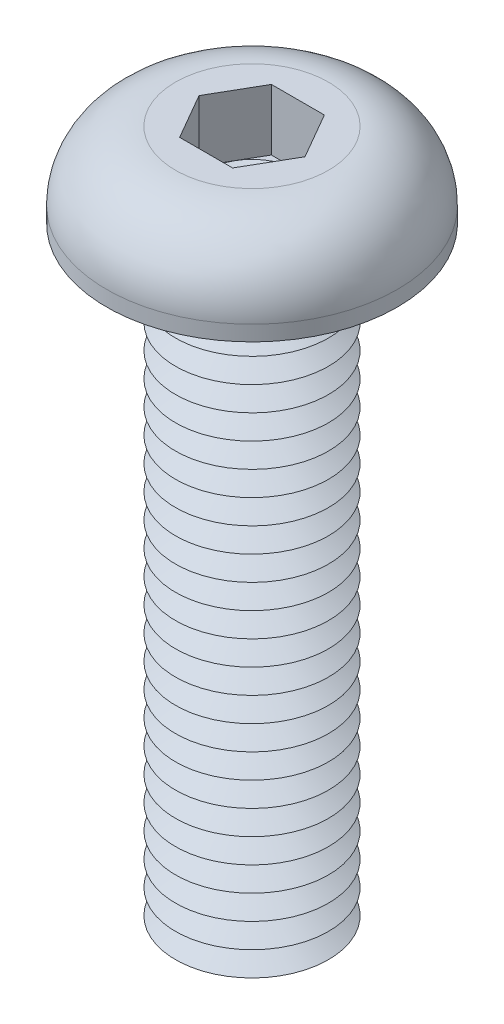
ISO-10303-21;
HEADER;
FILE_DESCRIPTION(('STEP AP214'),'2;1');
FILE_NAME('part.step','',(''),(''),'','','');
FILE_SCHEMA(('AUTOMOTIVE_DESIGN { 1 0 10303 214 1 1 1 1 }'));
ENDSEC;
DATA;
#1=APPLICATION_CONTEXT('core data for automotive mechanical design processes');
#2=APPLICATION_PROTOCOL_DEFINITION('international standard','automotive_design',2000,#1);
#3=PRODUCT_CONTEXT('',#1,'mechanical');
#4=PRODUCT('Part','Part','',(#3));
#5=PRODUCT_RELATED_PRODUCT_CATEGORY('part','',(#4));
#6=PRODUCT_DEFINITION_FORMATION('','',#4);
#7=PRODUCT_DEFINITION_CONTEXT('part definition',#1,'design');
#8=PRODUCT_DEFINITION('design','',#6,#7);
#9=PRODUCT_DEFINITION_SHAPE('','',#8);
#10=(LENGTH_UNIT() NAMED_UNIT(*) SI_UNIT(.MILLI.,.METRE.));
#11=(NAMED_UNIT(*) PLANE_ANGLE_UNIT() SI_UNIT($,.RADIAN.));
#12=(NAMED_UNIT(*) SI_UNIT($,.STERADIAN.) SOLID_ANGLE_UNIT());
#13=UNCERTAINTY_MEASURE_WITH_UNIT(LENGTH_MEASURE(1.E-05),#10,'distance_accuracy_value','');
#14=(GEOMETRIC_REPRESENTATION_CONTEXT(3) GLOBAL_UNCERTAINTY_ASSIGNED_CONTEXT((#13)) GLOBAL_UNIT_ASSIGNED_CONTEXT((#10,
#11,#12)) REPRESENTATION_CONTEXT('',''));
#15=CARTESIAN_POINT('',(0.,0.,0.));
#16=DIRECTION('',(0.,0.,1.));
#17=DIRECTION('',(1.,0.,0.));
#18=AXIS2_PLACEMENT_3D('',#15,#16,#17);
#19=CARTESIAN_POINT('',(0.,0.,0.));
#20=DIRECTION('',(0.,-1.,0.));
#21=DIRECTION('',(0.,0.,-1.));
#22=AXIS2_PLACEMENT_3D('',#19,#20,#21);
#23=TOROIDAL_SURFACE('',#22,2.9,0.4);
#24=CARTESIAN_POINT('',(0.,0.,-3.3));
#25=VERTEX_POINT('',#24);
#26=VERTEX_LOOP('',#25);
#27=FACE_BOUND('',#26,.T.);
#28=ADVANCED_FACE('P0_F12',(#27),#23,.T.);
#29=CLOSED_SHELL('',(#28));
#30=MANIFOLD_SOLID_BREP('P0_B1',#29);
#31=CARTESIAN_POINT('',(0.866025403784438,0.75,-1.5));
#32=DIRECTION('',(0.,1.,0.));
#33=DIRECTION('',(0.,0.,1.));
#34=AXIS2_PLACEMENT_3D('',#31,#32,#33);
#35=PLANE('',#34);
#36=CARTESIAN_POINT('',(0.,0.75,0.));
#37=DIRECTION('',(0.,1.,0.));
#38=DIRECTION('',(0.,0.,1.));
#39=AXIS2_PLACEMENT_3D('',#36,#37,#38);
#40=CIRCLE('',#39,1.5);
#41=CARTESIAN_POINT('',(0.,0.75,1.5));
#42=VERTEX_POINT('',#41);
#43=CARTESIAN_POINT('',(1.29903810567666,0.75,0.75));
#44=VERTEX_POINT('',#43);
#45=EDGE_CURVE('P1_E93',#42,#44,#40,.T.);
#46=ORIENTED_EDGE('',*,*,#45,.F.);
#47=DIRECTION('',(1.,0.,0.));
#48=VECTOR('',#47,1.);
#49=CARTESIAN_POINT('',(-0.866025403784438,0.75,1.5));
#50=LINE('',#49,#48);
#51=CARTESIAN_POINT('',(0.866025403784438,0.75,1.5));
#52=VERTEX_POINT('',#51);
#53=EDGE_CURVE('P1_E116',#42,#52,#50,.T.);
#54=ORIENTED_EDGE('',*,*,#53,.T.);
#55=DIRECTION('',(0.5,0.,-0.866025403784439));
#56=VECTOR('',#55,1.);
#57=CARTESIAN_POINT('',(0.866025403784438,0.75,1.5));
#58=LINE('',#57,#56);
#59=EDGE_CURVE('P1_E112',#52,#44,#58,.T.);
#60=ORIENTED_EDGE('',*,*,#59,.T.);
#61=EDGE_LOOP('',(#46,#54,#60));
#62=FACE_BOUND('',#61,.T.);
#63=ADVANCED_FACE('P1_F15',(#62),#35,.T.);
#64=CARTESIAN_POINT('',(0.,0.75,0.));
#65=DIRECTION('',(0.,1.,0.));
#66=DIRECTION('',(0.,0.,1.));
#67=AXIS2_PLACEMENT_3D('',#64,#65,#66);
#68=CIRCLE('',#67,1.5);
#69=CARTESIAN_POINT('',(1.29903810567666,0.75,-0.750000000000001));
#70=VERTEX_POINT('',#69);
#71=EDGE_CURVE('P1_E10',#44,#70,#68,.T.);
#72=ORIENTED_EDGE('',*,*,#71,.F.);
#73=CARTESIAN_POINT('',(1.73205080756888,0.75,0.));
#74=VERTEX_POINT('',#73);
#75=EDGE_CURVE('P1_E104',#44,#74,#58,.T.);
#76=ORIENTED_EDGE('',*,*,#75,.T.);
#77=DIRECTION('',(-0.5,0.,-0.866025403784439));
#78=VECTOR('',#77,1.);
#79=CARTESIAN_POINT('',(1.73205080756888,0.75,0.));
#80=LINE('',#79,#78);
#81=EDGE_CURVE('P1_E107',#74,#70,#80,.T.);
#82=ORIENTED_EDGE('',*,*,#81,.T.);
#83=EDGE_LOOP('',(#72,#76,#82));
#84=FACE_BOUND('',#83,.T.);
#85=ADVANCED_FACE('P1_F103',(#84),#35,.T.);
#86=CARTESIAN_POINT('',(0.,0.75,-1.5));
#87=VERTEX_POINT('',#86);
#88=EDGE_CURVE('P1_E24',#70,#87,#68,.T.);
#89=ORIENTED_EDGE('',*,*,#88,.F.);
#90=CARTESIAN_POINT('',(0.866025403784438,0.75,-1.5));
#91=VERTEX_POINT('',#90);
#92=EDGE_CURVE('P1_E139',#70,#91,#80,.T.);
#93=ORIENTED_EDGE('',*,*,#92,.T.);
#94=DIRECTION('',(-1.,0.,0.));
#95=VECTOR('',#94,1.);
#96=CARTESIAN_POINT('',(0.866025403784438,0.75,-1.5));
#97=LINE('',#96,#95);
#98=EDGE_CURVE('P1_E366',#91,#87,#97,.T.);
#99=ORIENTED_EDGE('',*,*,#98,.T.);
#100=EDGE_LOOP('',(#89,#93,#99));
#101=FACE_BOUND('',#100,.T.);
#102=ADVANCED_FACE('P1_F331',(#101),#35,.T.);
#103=CARTESIAN_POINT('',(-1.29903810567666,0.75,-0.75));
#104=VERTEX_POINT('',#103);
#105=EDGE_CURVE('P1_E361',#87,#104,#68,.T.);
#106=ORIENTED_EDGE('',*,*,#105,.F.);
#107=CARTESIAN_POINT('',(-0.866025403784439,0.75,-1.5));
#108=VERTEX_POINT('',#107);
#109=EDGE_CURVE('P1_E370',#87,#108,#97,.T.);
#110=ORIENTED_EDGE('',*,*,#109,.T.);
#111=DIRECTION('',(-0.5,0.,0.866025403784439));
#112=VECTOR('',#111,1.);
#113=CARTESIAN_POINT('',(-0.866025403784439,0.75,-1.5));
#114=LINE('',#113,#112);
#115=EDGE_CURVE('P1_E365',#108,#104,#114,.T.);
#116=ORIENTED_EDGE('',*,*,#115,.T.);
#117=EDGE_LOOP('',(#106,#110,#116));
#118=FACE_BOUND('',#117,.T.);
#119=ADVANCED_FACE('P1_F345',(#118),#35,.T.);
#120=CARTESIAN_POINT('',(-1.29903810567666,0.75,0.75));
#121=VERTEX_POINT('',#120);
#122=EDGE_CURVE('P1_E31',#104,#121,#68,.T.);
#123=ORIENTED_EDGE('',*,*,#122,.F.);
#124=CARTESIAN_POINT('',(-1.73205080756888,0.75,0.));
#125=VERTEX_POINT('',#124);
#126=EDGE_CURVE('P1_E357',#104,#125,#114,.T.);
#127=ORIENTED_EDGE('',*,*,#126,.T.);
#128=DIRECTION('',(0.5,0.,0.866025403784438));
#129=VECTOR('',#128,1.);
#130=CARTESIAN_POINT('',(-1.73205080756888,0.75,0.));
#131=LINE('',#130,#129);
#132=EDGE_CURVE('P1_E360',#125,#121,#131,.T.);
#133=ORIENTED_EDGE('',*,*,#132,.T.);
#134=EDGE_LOOP('',(#123,#127,#133));
#135=FACE_BOUND('',#134,.T.);
#136=ADVANCED_FACE('P1_F336',(#135),#35,.T.);
#137=CARTESIAN_POINT('',(0.,-19.2,0.));
#138=DIRECTION('',(0.,1.,0.));
#139=DIRECTION('',(0.,0.,1.));
#140=AXIS2_PLACEMENT_3D('',#137,#138,#139);
#141=CONICAL_SURFACE('',#140,1.80717967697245,1.0471975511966);
#142=CARTESIAN_POINT('',(0.,-18.8,0.));
#143=DIRECTION('',(0.,-1.,0.));
#144=DIRECTION('',(0.,0.,-1.));
#145=AXIS2_PLACEMENT_3D('',#142,#143,#144);
#146=CIRCLE('',#145,2.5);
#147=CARTESIAN_POINT('',(0.,-18.8,-2.5));
#148=VERTEX_POINT('',#147);
#149=EDGE_CURVE('P1_E293',#148,#148,#146,.T.);
#150=ORIENTED_EDGE('',*,*,#149,.T.);
#151=EDGE_LOOP('',(#150));
#152=FACE_BOUND('',#151,.T.);
#153=CARTESIAN_POINT('',(0.,-19.2,0.));
#154=DIRECTION('',(0.,-1.,0.));
#155=DIRECTION('',(0.,0.,-1.));
#156=AXIS2_PLACEMENT_3D('',#153,#154,#155);
#157=CIRCLE('',#156,1.80717967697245);
#158=CARTESIAN_POINT('',(0.,-19.2,-1.80717967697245));
#159=VERTEX_POINT('',#158);
#160=EDGE_CURVE('P1_E296',#159,#159,#157,.T.);
#161=ORIENTED_EDGE('',*,*,#160,.F.);
#162=EDGE_LOOP('',(#161));
#163=FACE_BOUND('',#162,.T.);
#164=ADVANCED_FACE('P1_F344',(#152,#163),#141,.T.);
#165=CARTESIAN_POINT('',(0.,-19.6,0.));
#166=DIRECTION('',(0.,-1.,0.));
#167=DIRECTION('',(0.,0.,-1.));
#168=AXIS2_PLACEMENT_3D('',#165,#166,#167);
#169=CONICAL_SURFACE('',#168,2.5,1.0471975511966);
#170=ORIENTED_EDGE('',*,*,#160,.T.);
#171=EDGE_LOOP('',(#170));
#172=FACE_BOUND('',#171,.T.);
#173=CARTESIAN_POINT('',(0.,-19.6,0.));
#174=DIRECTION('',(0.,-1.,0.));
#175=DIRECTION('',(0.,0.,-1.));
#176=AXIS2_PLACEMENT_3D('',#173,#174,#175);
#177=CIRCLE('',#176,2.5);
#178=CARTESIAN_POINT('',(0.,-19.6,-2.5));
#179=VERTEX_POINT('',#178);
#180=EDGE_CURVE('P1_E299',#179,#179,#177,.T.);
#181=ORIENTED_EDGE('',*,*,#180,.F.);
#182=EDGE_LOOP('',(#181));
#183=FACE_BOUND('',#182,.T.);
#184=ADVANCED_FACE('P1_F351',(#172,#183),#169,.T.);
#185=CARTESIAN_POINT('',(0.,-20.,0.));
#186=DIRECTION('',(0.,1.,0.));
#187=DIRECTION('',(0.,0.,1.));
#188=AXIS2_PLACEMENT_3D('',#185,#186,#187);
#189=PLANE('',#188);
#190=CARTESIAN_POINT('',(0.,-20.,0.));
#191=DIRECTION('',(0.,-1.,0.));
#192=DIRECTION('',(0.,0.,-1.));
#193=AXIS2_PLACEMENT_3D('',#190,#191,#192);
#194=CIRCLE('',#193,1.80717967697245);
#195=CARTESIAN_POINT('',(0.,-20.,-1.80717967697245));
#196=VERTEX_POINT('',#195);
#197=EDGE_CURVE('P1_E302',#196,#196,#194,.T.);
#198=ORIENTED_EDGE('',*,*,#197,.T.);
#199=EDGE_LOOP('',(#198));
#200=FACE_BOUND('',#199,.T.);
#201=ADVANCED_FACE('P1_F429',(#200),#189,.F.);
#202=CARTESIAN_POINT('',(0.,-20.,0.));
#203=DIRECTION('',(0.,1.,0.));
#204=DIRECTION('',(0.,0.,1.));
#205=AXIS2_PLACEMENT_3D('',#202,#203,#204);
#206=CONICAL_SURFACE('',#205,1.80717967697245,1.0471975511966);
#207=ORIENTED_EDGE('',*,*,#180,.T.);
#208=EDGE_LOOP('',(#207));
#209=FACE_BOUND('',#208,.T.);
#210=ORIENTED_EDGE('',*,*,#197,.F.);
#211=EDGE_LOOP('',(#210));
#212=FACE_BOUND('',#211,.T.);
#213=ADVANCED_FACE('P1_F440',(#209,#212),#206,.T.);
#214=CARTESIAN_POINT('',(0.,-18.4,0.));
#215=DIRECTION('',(0.,1.,0.));
#216=DIRECTION('',(0.,0.,1.));
#217=AXIS2_PLACEMENT_3D('',#214,#215,#216);
#218=CONICAL_SURFACE('',#217,1.80717967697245,1.0471975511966);
#219=CARTESIAN_POINT('',(0.,-18.,0.));
#220=DIRECTION('',(0.,-1.,0.));
#221=DIRECTION('',(0.,0.,-1.));
#222=AXIS2_PLACEMENT_3D('',#219,#220,#221);
#223=CIRCLE('',#222,2.5);
#224=CARTESIAN_POINT('',(0.,-18.,-2.5));
#225=VERTEX_POINT('',#224);
#226=EDGE_CURVE('P1_E287',#225,#225,#223,.T.);
#227=ORIENTED_EDGE('',*,*,#226,.T.);
#228=EDGE_LOOP('',(#227));
#229=FACE_BOUND('',#228,.T.);
#230=CARTESIAN_POINT('',(0.,-18.4,0.));
#231=DIRECTION('',(0.,-1.,0.));
#232=DIRECTION('',(0.,0.,-1.));
#233=AXIS2_PLACEMENT_3D('',#230,#231,#232);
#234=CIRCLE('',#233,1.80717967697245);
#235=CARTESIAN_POINT('',(0.,-18.4,-1.80717967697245));
#236=VERTEX_POINT('',#235);
#237=EDGE_CURVE('P1_E290',#236,#236,#234,.T.);
#238=ORIENTED_EDGE('',*,*,#237,.F.);
#239=EDGE_LOOP('',(#238));
#240=FACE_BOUND('',#239,.T.);
#241=ADVANCED_FACE('P1_F449',(#229,#240),#218,.T.);
#242=CARTESIAN_POINT('',(0.,-18.8,0.));
#243=DIRECTION('',(0.,-1.,0.));
#244=DIRECTION('',(0.,0.,-1.));
#245=AXIS2_PLACEMENT_3D('',#242,#243,#244);
#246=CONICAL_SURFACE('',#245,2.5,1.0471975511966);
#247=ORIENTED_EDGE('',*,*,#237,.T.);
#248=EDGE_LOOP('',(#247));
#249=FACE_BOUND('',#248,.T.);
#250=ORIENTED_EDGE('',*,*,#149,.F.);
#251=EDGE_LOOP('',(#250));
#252=FACE_BOUND('',#251,.T.);
#253=ADVANCED_FACE('P1_F458',(#249,#252),#246,.T.);
#254=CARTESIAN_POINT('',(0.,-17.6,0.));
#255=DIRECTION('',(0.,1.,0.));
#256=DIRECTION('',(0.,0.,1.));
#257=AXIS2_PLACEMENT_3D('',#254,#255,#256);
#258=CONICAL_SURFACE('',#257,1.80717967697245,1.0471975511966);
#259=CARTESIAN_POINT('',(0.,-17.2,0.));
#260=DIRECTION('',(0.,-1.,0.));
#261=DIRECTION('',(0.,0.,-1.));
#262=AXIS2_PLACEMENT_3D('',#259,#260,#261);
#263=CIRCLE('',#262,2.5);
#264=CARTESIAN_POINT('',(0.,-17.2,-2.5));
#265=VERTEX_POINT('',#264);
#266=EDGE_CURVE('P1_E281',#265,#265,#263,.T.);
#267=ORIENTED_EDGE('',*,*,#266,.T.);
#268=EDGE_LOOP('',(#267));
#269=FACE_BOUND('',#268,.T.);
#270=CARTESIAN_POINT('',(0.,-17.6,0.));
#271=DIRECTION('',(0.,-1.,0.));
#272=DIRECTION('',(0.,0.,-1.));
#273=AXIS2_PLACEMENT_3D('',#270,#271,#272);
#274=CIRCLE('',#273,1.80717967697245);
#275=CARTESIAN_POINT('',(0.,-17.6,-1.80717967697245));
#276=VERTEX_POINT('',#275);
#277=EDGE_CURVE('P1_E284',#276,#276,#274,.T.);
#278=ORIENTED_EDGE('',*,*,#277,.F.);
#279=EDGE_LOOP('',(#278));
#280=FACE_BOUND('',#279,.T.);
#281=ADVANCED_FACE('P1_F468',(#269,#280),#258,.T.);
#282=CARTESIAN_POINT('',(0.,-18.,0.));
#283=DIRECTION('',(0.,-1.,0.));
#284=DIRECTION('',(0.,0.,-1.));
#285=AXIS2_PLACEMENT_3D('',#282,#283,#284);
#286=CONICAL_SURFACE('',#285,2.5,1.0471975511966);
#287=ORIENTED_EDGE('',*,*,#277,.T.);
#288=EDGE_LOOP('',(#287));
#289=FACE_BOUND('',#288,.T.);
#290=ORIENTED_EDGE('',*,*,#226,.F.);
#291=EDGE_LOOP('',(#290));
#292=FACE_BOUND('',#291,.T.);
#293=ADVANCED_FACE('P1_F478',(#289,#292),#286,.T.);
#294=CARTESIAN_POINT('',(0.,-16.8,0.));
#295=DIRECTION('',(0.,1.,0.));
#296=DIRECTION('',(0.,0.,1.));
#297=AXIS2_PLACEMENT_3D('',#294,#295,#296);
#298=CONICAL_SURFACE('',#297,1.80717967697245,1.0471975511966);
#299=CARTESIAN_POINT('',(0.,-16.4,0.));
#300=DIRECTION('',(0.,-1.,0.));
#301=DIRECTION('',(0.,0.,-1.));
#302=AXIS2_PLACEMENT_3D('',#299,#300,#301);
#303=CIRCLE('',#302,2.5);
#304=CARTESIAN_POINT('',(0.,-16.4,-2.5));
#305=VERTEX_POINT('',#304);
#306=EDGE_CURVE('P1_E275',#305,#305,#303,.T.);
#307=ORIENTED_EDGE('',*,*,#306,.T.);
#308=EDGE_LOOP('',(#307));
#309=FACE_BOUND('',#308,.T.);
#310=CARTESIAN_POINT('',(0.,-16.8,0.));
#311=DIRECTION('',(0.,-1.,0.));
#312=DIRECTION('',(0.,0.,-1.));
#313=AXIS2_PLACEMENT_3D('',#310,#311,#312);
#314=CIRCLE('',#313,1.80717967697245);
#315=CARTESIAN_POINT('',(0.,-16.8,-1.80717967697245));
#316=VERTEX_POINT('',#315);
#317=EDGE_CURVE('P1_E278',#316,#316,#314,.T.);
#318=ORIENTED_EDGE('',*,*,#317,.F.);
#319=EDGE_LOOP('',(#318));
#320=FACE_BOUND('',#319,.T.);
#321=ADVANCED_FACE('P1_F488',(#309,#320),#298,.T.);
#322=CARTESIAN_POINT('',(0.,-17.2,0.));
#323=DIRECTION('',(0.,-1.,0.));
#324=DIRECTION('',(0.,0.,-1.));
#325=AXIS2_PLACEMENT_3D('',#322,#323,#324);
#326=CONICAL_SURFACE('',#325,2.5,1.0471975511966);
#327=ORIENTED_EDGE('',*,*,#317,.T.);
#328=EDGE_LOOP('',(#327));
#329=FACE_BOUND('',#328,.T.);
#330=ORIENTED_EDGE('',*,*,#266,.F.);
#331=EDGE_LOOP('',(#330));
#332=FACE_BOUND('',#331,.T.);
#333=ADVANCED_FACE('P1_F498',(#329,#332),#326,.T.);
#334=CARTESIAN_POINT('',(0.,-16.,0.));
#335=DIRECTION('',(0.,1.,0.));
#336=DIRECTION('',(0.,0.,1.));
#337=AXIS2_PLACEMENT_3D('',#334,#335,#336);
#338=CONICAL_SURFACE('',#337,1.80717967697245,1.0471975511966);
#339=CARTESIAN_POINT('',(0.,-15.6,0.));
#340=DIRECTION('',(0.,-1.,0.));
#341=DIRECTION('',(0.,0.,-1.));
#342=AXIS2_PLACEMENT_3D('',#339,#340,#341);
#343=CIRCLE('',#342,2.5);
#344=CARTESIAN_POINT('',(0.,-15.6,-2.5));
#345=VERTEX_POINT('',#344);
#346=EDGE_CURVE('P1_E269',#345,#345,#343,.T.);
#347=ORIENTED_EDGE('',*,*,#346,.T.);
#348=EDGE_LOOP('',(#347));
#349=FACE_BOUND('',#348,.T.);
#350=CARTESIAN_POINT('',(0.,-16.,0.));
#351=DIRECTION('',(0.,-1.,0.));
#352=DIRECTION('',(0.,0.,-1.));
#353=AXIS2_PLACEMENT_3D('',#350,#351,#352);
#354=CIRCLE('',#353,1.80717967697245);
#355=CARTESIAN_POINT('',(0.,-16.,-1.80717967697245));
#356=VERTEX_POINT('',#355);
#357=EDGE_CURVE('P1_E272',#356,#356,#354,.T.);
#358=ORIENTED_EDGE('',*,*,#357,.F.);
#359=EDGE_LOOP('',(#358));
#360=FACE_BOUND('',#359,.T.);
#361=ADVANCED_FACE('P1_F508',(#349,#360),#338,.T.);
#362=CARTESIAN_POINT('',(0.,-16.4,0.));
#363=DIRECTION('',(0.,-1.,0.));
#364=DIRECTION('',(0.,0.,-1.));
#365=AXIS2_PLACEMENT_3D('',#362,#363,#364);
#366=CONICAL_SURFACE('',#365,2.5,1.0471975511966);
#367=ORIENTED_EDGE('',*,*,#357,.T.);
#368=EDGE_LOOP('',(#367));
#369=FACE_BOUND('',#368,.T.);
#370=ORIENTED_EDGE('',*,*,#306,.F.);
#371=EDGE_LOOP('',(#370));
#372=FACE_BOUND('',#371,.T.);
#373=ADVANCED_FACE('P1_F518',(#369,#372),#366,.T.);
#374=CARTESIAN_POINT('',(0.,-15.2,0.));
#375=DIRECTION('',(0.,1.,0.));
#376=DIRECTION('',(0.,0.,1.));
#377=AXIS2_PLACEMENT_3D('',#374,#375,#376);
#378=CONICAL_SURFACE('',#377,1.80717967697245,1.0471975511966);
#379=CARTESIAN_POINT('',(0.,-14.8,0.));
#380=DIRECTION('',(0.,-1.,0.));
#381=DIRECTION('',(0.,0.,-1.));
#382=AXIS2_PLACEMENT_3D('',#379,#380,#381);
#383=CIRCLE('',#382,2.5);
#384=CARTESIAN_POINT('',(0.,-14.8,-2.5));
#385=VERTEX_POINT('',#384);
#386=EDGE_CURVE('P1_E263',#385,#385,#383,.T.);
#387=ORIENTED_EDGE('',*,*,#386,.T.);
#388=EDGE_LOOP('',(#387));
#389=FACE_BOUND('',#388,.T.);
#390=CARTESIAN_POINT('',(0.,-15.2,0.));
#391=DIRECTION('',(0.,-1.,0.));
#392=DIRECTION('',(0.,0.,-1.));
#393=AXIS2_PLACEMENT_3D('',#390,#391,#392);
#394=CIRCLE('',#393,1.80717967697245);
#395=CARTESIAN_POINT('',(0.,-15.2,-1.80717967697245));
#396=VERTEX_POINT('',#395);
#397=EDGE_CURVE('P1_E266',#396,#396,#394,.T.);
#398=ORIENTED_EDGE('',*,*,#397,.F.);
#399=EDGE_LOOP('',(#398));
#400=FACE_BOUND('',#399,.T.);
#401=ADVANCED_FACE('P1_F528',(#389,#400),#378,.T.);
#402=CARTESIAN_POINT('',(0.,-15.6,0.));
#403=DIRECTION('',(0.,-1.,0.));
#404=DIRECTION('',(0.,0.,-1.));
#405=AXIS2_PLACEMENT_3D('',#402,#403,#404);
#406=CONICAL_SURFACE('',#405,2.5,1.0471975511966);
#407=ORIENTED_EDGE('',*,*,#397,.T.);
#408=EDGE_LOOP('',(#407));
#409=FACE_BOUND('',#408,.T.);
#410=ORIENTED_EDGE('',*,*,#346,.F.);
#411=EDGE_LOOP('',(#410));
#412=FACE_BOUND('',#411,.T.);
#413=ADVANCED_FACE('P1_F538',(#409,#412),#406,.T.);
#414=CARTESIAN_POINT('',(0.,-14.4,0.));
#415=DIRECTION('',(0.,1.,0.));
#416=DIRECTION('',(0.,0.,1.));
#417=AXIS2_PLACEMENT_3D('',#414,#415,#416);
#418=CONICAL_SURFACE('',#417,1.80717967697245,1.0471975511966);
#419=CARTESIAN_POINT('',(0.,-14.,0.));
#420=DIRECTION('',(0.,-1.,0.));
#421=DIRECTION('',(0.,0.,-1.));
#422=AXIS2_PLACEMENT_3D('',#419,#420,#421);
#423=CIRCLE('',#422,2.5);
#424=CARTESIAN_POINT('',(0.,-14.,-2.5));
#425=VERTEX_POINT('',#424);
#426=EDGE_CURVE('P1_E257',#425,#425,#423,.T.);
#427=ORIENTED_EDGE('',*,*,#426,.T.);
#428=EDGE_LOOP('',(#427));
#429=FACE_BOUND('',#428,.T.);
#430=CARTESIAN_POINT('',(0.,-14.4,0.));
#431=DIRECTION('',(0.,-1.,0.));
#432=DIRECTION('',(0.,0.,-1.));
#433=AXIS2_PLACEMENT_3D('',#430,#431,#432);
#434=CIRCLE('',#433,1.80717967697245);
#435=CARTESIAN_POINT('',(0.,-14.4,-1.80717967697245));
#436=VERTEX_POINT('',#435);
#437=EDGE_CURVE('P1_E260',#436,#436,#434,.T.);
#438=ORIENTED_EDGE('',*,*,#437,.F.);
#439=EDGE_LOOP('',(#438));
#440=FACE_BOUND('',#439,.T.);
#441=ADVANCED_FACE('P1_F548',(#429,#440),#418,.T.);
#442=CARTESIAN_POINT('',(0.,-14.8,0.));
#443=DIRECTION('',(0.,-1.,0.));
#444=DIRECTION('',(0.,0.,-1.));
#445=AXIS2_PLACEMENT_3D('',#442,#443,#444);
#446=CONICAL_SURFACE('',#445,2.5,1.0471975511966);
#447=ORIENTED_EDGE('',*,*,#437,.T.);
#448=EDGE_LOOP('',(#447));
#449=FACE_BOUND('',#448,.T.);
#450=ORIENTED_EDGE('',*,*,#386,.F.);
#451=EDGE_LOOP('',(#450));
#452=FACE_BOUND('',#451,.T.);
#453=ADVANCED_FACE('P1_F558',(#449,#452),#446,.T.);
#454=CARTESIAN_POINT('',(0.,-13.6,0.));
#455=DIRECTION('',(0.,1.,0.));
#456=DIRECTION('',(0.,0.,1.));
#457=AXIS2_PLACEMENT_3D('',#454,#455,#456);
#458=CONICAL_SURFACE('',#457,1.80717967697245,1.0471975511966);
#459=CARTESIAN_POINT('',(0.,-13.2,0.));
#460=DIRECTION('',(0.,-1.,0.));
#461=DIRECTION('',(0.,0.,-1.));
#462=AXIS2_PLACEMENT_3D('',#459,#460,#461);
#463=CIRCLE('',#462,2.5);
#464=CARTESIAN_POINT('',(0.,-13.2,-2.5));
#465=VERTEX_POINT('',#464);
#466=EDGE_CURVE('P1_E251',#465,#465,#463,.T.);
#467=ORIENTED_EDGE('',*,*,#466,.T.);
#468=EDGE_LOOP('',(#467));
#469=FACE_BOUND('',#468,.T.);
#470=CARTESIAN_POINT('',(0.,-13.6,0.));
#471=DIRECTION('',(0.,-1.,0.));
#472=DIRECTION('',(0.,0.,-1.));
#473=AXIS2_PLACEMENT_3D('',#470,#471,#472);
#474=CIRCLE('',#473,1.80717967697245);
#475=CARTESIAN_POINT('',(0.,-13.6,-1.80717967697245));
#476=VERTEX_POINT('',#475);
#477=EDGE_CURVE('P1_E254',#476,#476,#474,.T.);
#478=ORIENTED_EDGE('',*,*,#477,.F.);
#479=EDGE_LOOP('',(#478));
#480=FACE_BOUND('',#479,.T.);
#481=ADVANCED_FACE('P1_F568',(#469,#480),#458,.T.);
#482=CARTESIAN_POINT('',(0.,-14.,0.));
#483=DIRECTION('',(0.,-1.,0.));
#484=DIRECTION('',(0.,0.,-1.));
#485=AXIS2_PLACEMENT_3D('',#482,#483,#484);
#486=CONICAL_SURFACE('',#485,2.5,1.0471975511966);
#487=ORIENTED_EDGE('',*,*,#477,.T.);
#488=EDGE_LOOP('',(#487));
#489=FACE_BOUND('',#488,.T.);
#490=ORIENTED_EDGE('',*,*,#426,.F.);
#491=EDGE_LOOP('',(#490));
#492=FACE_BOUND('',#491,.T.);
#493=ADVANCED_FACE('P1_F578',(#489,#492),#486,.T.);
#494=CARTESIAN_POINT('',(0.,-12.8,0.));
#495=DIRECTION('',(0.,1.,0.));
#496=DIRECTION('',(0.,0.,1.));
#497=AXIS2_PLACEMENT_3D('',#494,#495,#496);
#498=CONICAL_SURFACE('',#497,1.80717967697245,1.0471975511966);
#499=CARTESIAN_POINT('',(0.,-12.4,0.));
#500=DIRECTION('',(0.,-1.,0.));
#501=DIRECTION('',(0.,0.,-1.));
#502=AXIS2_PLACEMENT_3D('',#499,#500,#501);
#503=CIRCLE('',#502,2.5);
#504=CARTESIAN_POINT('',(0.,-12.4,-2.5));
#505=VERTEX_POINT('',#504);
#506=EDGE_CURVE('P1_E245',#505,#505,#503,.T.);
#507=ORIENTED_EDGE('',*,*,#506,.T.);
#508=EDGE_LOOP('',(#507));
#509=FACE_BOUND('',#508,.T.);
#510=CARTESIAN_POINT('',(0.,-12.8,0.));
#511=DIRECTION('',(0.,-1.,0.));
#512=DIRECTION('',(0.,0.,-1.));
#513=AXIS2_PLACEMENT_3D('',#510,#511,#512);
#514=CIRCLE('',#513,1.80717967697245);
#515=CARTESIAN_POINT('',(0.,-12.8,-1.80717967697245));
#516=VERTEX_POINT('',#515);
#517=EDGE_CURVE('P1_E248',#516,#516,#514,.T.);
#518=ORIENTED_EDGE('',*,*,#517,.F.);
#519=EDGE_LOOP('',(#518));
#520=FACE_BOUND('',#519,.T.);
#521=ADVANCED_FACE('P1_F588',(#509,#520),#498,.T.);
#522=CARTESIAN_POINT('',(0.,-13.2,0.));
#523=DIRECTION('',(0.,-1.,0.));
#524=DIRECTION('',(0.,0.,-1.));
#525=AXIS2_PLACEMENT_3D('',#522,#523,#524);
#526=CONICAL_SURFACE('',#525,2.5,1.0471975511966);
#527=ORIENTED_EDGE('',*,*,#517,.T.);
#528=EDGE_LOOP('',(#527));
#529=FACE_BOUND('',#528,.T.);
#530=ORIENTED_EDGE('',*,*,#466,.F.);
#531=EDGE_LOOP('',(#530));
#532=FACE_BOUND('',#531,.T.);
#533=ADVANCED_FACE('P1_F598',(#529,#532),#526,.T.);
#534=CARTESIAN_POINT('',(0.,-12.,0.));
#535=DIRECTION('',(0.,1.,0.));
#536=DIRECTION('',(0.,0.,1.));
#537=AXIS2_PLACEMENT_3D('',#534,#535,#536);
#538=CONICAL_SURFACE('',#537,1.80717967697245,1.0471975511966);
#539=CARTESIAN_POINT('',(0.,-11.6,0.));
#540=DIRECTION('',(0.,-1.,0.));
#541=DIRECTION('',(0.,0.,-1.));
#542=AXIS2_PLACEMENT_3D('',#539,#540,#541);
#543=CIRCLE('',#542,2.5);
#544=CARTESIAN_POINT('',(0.,-11.6,-2.5));
#545=VERTEX_POINT('',#544);
#546=EDGE_CURVE('P1_E239',#545,#545,#543,.T.);
#547=ORIENTED_EDGE('',*,*,#546,.T.);
#548=EDGE_LOOP('',(#547));
#549=FACE_BOUND('',#548,.T.);
#550=CARTESIAN_POINT('',(0.,-12.,0.));
#551=DIRECTION('',(0.,-1.,0.));
#552=DIRECTION('',(0.,0.,-1.));
#553=AXIS2_PLACEMENT_3D('',#550,#551,#552);
#554=CIRCLE('',#553,1.80717967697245);
#555=CARTESIAN_POINT('',(0.,-12.,-1.80717967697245));
#556=VERTEX_POINT('',#555);
#557=EDGE_CURVE('P1_E242',#556,#556,#554,.T.);
#558=ORIENTED_EDGE('',*,*,#557,.F.);
#559=EDGE_LOOP('',(#558));
#560=FACE_BOUND('',#559,.T.);
#561=ADVANCED_FACE('P1_F608',(#549,#560),#538,.T.);
#562=CARTESIAN_POINT('',(0.,-12.4,0.));
#563=DIRECTION('',(0.,-1.,0.));
#564=DIRECTION('',(0.,0.,-1.));
#565=AXIS2_PLACEMENT_3D('',#562,#563,#564);
#566=CONICAL_SURFACE('',#565,2.5,1.0471975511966);
#567=ORIENTED_EDGE('',*,*,#557,.T.);
#568=EDGE_LOOP('',(#567));
#569=FACE_BOUND('',#568,.T.);
#570=ORIENTED_EDGE('',*,*,#506,.F.);
#571=EDGE_LOOP('',(#570));
#572=FACE_BOUND('',#571,.T.);
#573=ADVANCED_FACE('P1_F618',(#569,#572),#566,.T.);
#574=CARTESIAN_POINT('',(0.,-11.2,0.));
#575=DIRECTION('',(0.,1.,0.));
#576=DIRECTION('',(0.,0.,1.));
#577=AXIS2_PLACEMENT_3D('',#574,#575,#576);
#578=CONICAL_SURFACE('',#577,1.80717967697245,1.0471975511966);
#579=CARTESIAN_POINT('',(0.,-10.8,0.));
#580=DIRECTION('',(0.,-1.,0.));
#581=DIRECTION('',(0.,0.,-1.));
#582=AXIS2_PLACEMENT_3D('',#579,#580,#581);
#583=CIRCLE('',#582,2.5);
#584=CARTESIAN_POINT('',(0.,-10.8,-2.5));
#585=VERTEX_POINT('',#584);
#586=EDGE_CURVE('P1_E233',#585,#585,#583,.T.);
#587=ORIENTED_EDGE('',*,*,#586,.T.);
#588=EDGE_LOOP('',(#587));
#589=FACE_BOUND('',#588,.T.);
#590=CARTESIAN_POINT('',(0.,-11.2,0.));
#591=DIRECTION('',(0.,-1.,0.));
#592=DIRECTION('',(0.,0.,-1.));
#593=AXIS2_PLACEMENT_3D('',#590,#591,#592);
#594=CIRCLE('',#593,1.80717967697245);
#595=CARTESIAN_POINT('',(0.,-11.2,-1.80717967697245));
#596=VERTEX_POINT('',#595);
#597=EDGE_CURVE('P1_E236',#596,#596,#594,.T.);
#598=ORIENTED_EDGE('',*,*,#597,.F.);
#599=EDGE_LOOP('',(#598));
#600=FACE_BOUND('',#599,.T.);
#601=ADVANCED_FACE('P1_F628',(#589,#600),#578,.T.);
#602=CARTESIAN_POINT('',(0.,-11.6,0.));
#603=DIRECTION('',(0.,-1.,0.));
#604=DIRECTION('',(0.,0.,-1.));
#605=AXIS2_PLACEMENT_3D('',#602,#603,#604);
#606=CONICAL_SURFACE('',#605,2.5,1.0471975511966);
#607=ORIENTED_EDGE('',*,*,#597,.T.);
#608=EDGE_LOOP('',(#607));
#609=FACE_BOUND('',#608,.T.);
#610=ORIENTED_EDGE('',*,*,#546,.F.);
#611=EDGE_LOOP('',(#610));
#612=FACE_BOUND('',#611,.T.);
#613=ADVANCED_FACE('P1_F638',(#609,#612),#606,.T.);
#614=CARTESIAN_POINT('',(0.,-10.4,0.));
#615=DIRECTION('',(0.,1.,0.));
#616=DIRECTION('',(0.,0.,1.));
#617=AXIS2_PLACEMENT_3D('',#614,#615,#616);
#618=CONICAL_SURFACE('',#617,1.80717967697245,1.0471975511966);
#619=CARTESIAN_POINT('',(0.,-10.,0.));
#620=DIRECTION('',(0.,-1.,0.));
#621=DIRECTION('',(0.,0.,-1.));
#622=AXIS2_PLACEMENT_3D('',#619,#620,#621);
#623=CIRCLE('',#622,2.5);
#624=CARTESIAN_POINT('',(0.,-10.,-2.5));
#625=VERTEX_POINT('',#624);
#626=EDGE_CURVE('P1_E227',#625,#625,#623,.T.);
#627=ORIENTED_EDGE('',*,*,#626,.T.);
#628=EDGE_LOOP('',(#627));
#629=FACE_BOUND('',#628,.T.);
#630=CARTESIAN_POINT('',(0.,-10.4,0.));
#631=DIRECTION('',(0.,-1.,0.));
#632=DIRECTION('',(0.,0.,-1.));
#633=AXIS2_PLACEMENT_3D('',#630,#631,#632);
#634=CIRCLE('',#633,1.80717967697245);
#635=CARTESIAN_POINT('',(0.,-10.4,-1.80717967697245));
#636=VERTEX_POINT('',#635);
#637=EDGE_CURVE('P1_E230',#636,#636,#634,.T.);
#638=ORIENTED_EDGE('',*,*,#637,.F.);
#639=EDGE_LOOP('',(#638));
#640=FACE_BOUND('',#639,.T.);
#641=ADVANCED_FACE('P1_F648',(#629,#640),#618,.T.);
#642=CARTESIAN_POINT('',(0.,-10.8,0.));
#643=DIRECTION('',(0.,-1.,0.));
#644=DIRECTION('',(0.,0.,-1.));
#645=AXIS2_PLACEMENT_3D('',#642,#643,#644);
#646=CONICAL_SURFACE('',#645,2.5,1.0471975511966);
#647=ORIENTED_EDGE('',*,*,#637,.T.);
#648=EDGE_LOOP('',(#647));
#649=FACE_BOUND('',#648,.T.);
#650=ORIENTED_EDGE('',*,*,#586,.F.);
#651=EDGE_LOOP('',(#650));
#652=FACE_BOUND('',#651,.T.);
#653=ADVANCED_FACE('P1_F658',(#649,#652),#646,.T.);
#654=CARTESIAN_POINT('',(0.,-9.6,0.));
#655=DIRECTION('',(0.,1.,0.));
#656=DIRECTION('',(0.,0.,1.));
#657=AXIS2_PLACEMENT_3D('',#654,#655,#656);
#658=CONICAL_SURFACE('',#657,1.80717967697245,1.0471975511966);
#659=CARTESIAN_POINT('',(0.,-9.2,0.));
#660=DIRECTION('',(0.,-1.,0.));
#661=DIRECTION('',(0.,0.,-1.));
#662=AXIS2_PLACEMENT_3D('',#659,#660,#661);
#663=CIRCLE('',#662,2.5);
#664=CARTESIAN_POINT('',(0.,-9.2,-2.5));
#665=VERTEX_POINT('',#664);
#666=EDGE_CURVE('P1_E221',#665,#665,#663,.T.);
#667=ORIENTED_EDGE('',*,*,#666,.T.);
#668=EDGE_LOOP('',(#667));
#669=FACE_BOUND('',#668,.T.);
#670=CARTESIAN_POINT('',(0.,-9.6,0.));
#671=DIRECTION('',(0.,-1.,0.));
#672=DIRECTION('',(0.,0.,-1.));
#673=AXIS2_PLACEMENT_3D('',#670,#671,#672);
#674=CIRCLE('',#673,1.80717967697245);
#675=CARTESIAN_POINT('',(0.,-9.6,-1.80717967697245));
#676=VERTEX_POINT('',#675);
#677=EDGE_CURVE('P1_E224',#676,#676,#674,.T.);
#678=ORIENTED_EDGE('',*,*,#677,.F.);
#679=EDGE_LOOP('',(#678));
#680=FACE_BOUND('',#679,.T.);
#681=ADVANCED_FACE('P1_F668',(#669,#680),#658,.T.);
#682=CARTESIAN_POINT('',(0.,-10.,0.));
#683=DIRECTION('',(0.,-1.,0.));
#684=DIRECTION('',(0.,0.,-1.));
#685=AXIS2_PLACEMENT_3D('',#682,#683,#684);
#686=CONICAL_SURFACE('',#685,2.5,1.0471975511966);
#687=ORIENTED_EDGE('',*,*,#677,.T.);
#688=EDGE_LOOP('',(#687));
#689=FACE_BOUND('',#688,.T.);
#690=ORIENTED_EDGE('',*,*,#626,.F.);
#691=EDGE_LOOP('',(#690));
#692=FACE_BOUND('',#691,.T.);
#693=ADVANCED_FACE('P1_F678',(#689,#692),#686,.T.);
#694=CARTESIAN_POINT('',(0.,-8.8,0.));
#695=DIRECTION('',(0.,1.,0.));
#696=DIRECTION('',(0.,0.,1.));
#697=AXIS2_PLACEMENT_3D('',#694,#695,#696);
#698=CONICAL_SURFACE('',#697,1.80717967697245,1.0471975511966);
#699=CARTESIAN_POINT('',(0.,-8.4,0.));
#700=DIRECTION('',(0.,-1.,0.));
#701=DIRECTION('',(0.,0.,-1.));
#702=AXIS2_PLACEMENT_3D('',#699,#700,#701);
#703=CIRCLE('',#702,2.5);
#704=CARTESIAN_POINT('',(0.,-8.4,-2.5));
#705=VERTEX_POINT('',#704);
#706=EDGE_CURVE('P1_E215',#705,#705,#703,.T.);
#707=ORIENTED_EDGE('',*,*,#706,.T.);
#708=EDGE_LOOP('',(#707));
#709=FACE_BOUND('',#708,.T.);
#710=CARTESIAN_POINT('',(0.,-8.8,0.));
#711=DIRECTION('',(0.,-1.,0.));
#712=DIRECTION('',(0.,0.,-1.));
#713=AXIS2_PLACEMENT_3D('',#710,#711,#712);
#714=CIRCLE('',#713,1.80717967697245);
#715=CARTESIAN_POINT('',(0.,-8.8,-1.80717967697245));
#716=VERTEX_POINT('',#715);
#717=EDGE_CURVE('P1_E218',#716,#716,#714,.T.);
#718=ORIENTED_EDGE('',*,*,#717,.F.);
#719=EDGE_LOOP('',(#718));
#720=FACE_BOUND('',#719,.T.);
#721=ADVANCED_FACE('P1_F688',(#709,#720),#698,.T.);
#722=CARTESIAN_POINT('',(0.,-9.2,0.));
#723=DIRECTION('',(0.,-1.,0.));
#724=DIRECTION('',(0.,0.,-1.));
#725=AXIS2_PLACEMENT_3D('',#722,#723,#724);
#726=CONICAL_SURFACE('',#725,2.5,1.0471975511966);
#727=ORIENTED_EDGE('',*,*,#717,.T.);
#728=EDGE_LOOP('',(#727));
#729=FACE_BOUND('',#728,.T.);
#730=ORIENTED_EDGE('',*,*,#666,.F.);
#731=EDGE_LOOP('',(#730));
#732=FACE_BOUND('',#731,.T.);
#733=ADVANCED_FACE('P1_F698',(#729,#732),#726,.T.);
#734=CARTESIAN_POINT('',(0.,-8.,0.));
#735=DIRECTION('',(0.,1.,0.));
#736=DIRECTION('',(0.,0.,1.));
#737=AXIS2_PLACEMENT_3D('',#734,#735,#736);
#738=CONICAL_SURFACE('',#737,1.80717967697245,1.0471975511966);
#739=CARTESIAN_POINT('',(0.,-7.6,0.));
#740=DIRECTION('',(0.,-1.,0.));
#741=DIRECTION('',(0.,0.,-1.));
#742=AXIS2_PLACEMENT_3D('',#739,#740,#741);
#743=CIRCLE('',#742,2.5);
#744=CARTESIAN_POINT('',(0.,-7.6,-2.5));
#745=VERTEX_POINT('',#744);
#746=EDGE_CURVE('P1_E209',#745,#745,#743,.T.);
#747=ORIENTED_EDGE('',*,*,#746,.T.);
#748=EDGE_LOOP('',(#747));
#749=FACE_BOUND('',#748,.T.);
#750=CARTESIAN_POINT('',(0.,-8.,0.));
#751=DIRECTION('',(0.,-1.,0.));
#752=DIRECTION('',(0.,0.,-1.));
#753=AXIS2_PLACEMENT_3D('',#750,#751,#752);
#754=CIRCLE('',#753,1.80717967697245);
#755=CARTESIAN_POINT('',(0.,-8.,-1.80717967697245));
#756=VERTEX_POINT('',#755);
#757=EDGE_CURVE('P1_E212',#756,#756,#754,.T.);
#758=ORIENTED_EDGE('',*,*,#757,.F.);
#759=EDGE_LOOP('',(#758));
#760=FACE_BOUND('',#759,.T.);
#761=ADVANCED_FACE('P1_F708',(#749,#760),#738,.T.);
#762=CARTESIAN_POINT('',(0.,-8.4,0.));
#763=DIRECTION('',(0.,-1.,0.));
#764=DIRECTION('',(0.,0.,-1.));
#765=AXIS2_PLACEMENT_3D('',#762,#763,#764);
#766=CONICAL_SURFACE('',#765,2.5,1.0471975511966);
#767=ORIENTED_EDGE('',*,*,#757,.T.);
#768=EDGE_LOOP('',(#767));
#769=FACE_BOUND('',#768,.T.);
#770=ORIENTED_EDGE('',*,*,#706,.F.);
#771=EDGE_LOOP('',(#770));
#772=FACE_BOUND('',#771,.T.);
#773=ADVANCED_FACE('P1_F718',(#769,#772),#766,.T.);
#774=CARTESIAN_POINT('',(0.,-7.2,0.));
#775=DIRECTION('',(0.,1.,0.));
#776=DIRECTION('',(0.,0.,1.));
#777=AXIS2_PLACEMENT_3D('',#774,#775,#776);
#778=CONICAL_SURFACE('',#777,1.80717967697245,1.0471975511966);
#779=CARTESIAN_POINT('',(0.,-6.8,0.));
#780=DIRECTION('',(0.,-1.,0.));
#781=DIRECTION('',(0.,0.,-1.));
#782=AXIS2_PLACEMENT_3D('',#779,#780,#781);
#783=CIRCLE('',#782,2.5);
#784=CARTESIAN_POINT('',(0.,-6.8,-2.5));
#785=VERTEX_POINT('',#784);
#786=EDGE_CURVE('P1_E203',#785,#785,#783,.T.);
#787=ORIENTED_EDGE('',*,*,#786,.T.);
#788=EDGE_LOOP('',(#787));
#789=FACE_BOUND('',#788,.T.);
#790=CARTESIAN_POINT('',(0.,-7.2,0.));
#791=DIRECTION('',(0.,-1.,0.));
#792=DIRECTION('',(0.,0.,-1.));
#793=AXIS2_PLACEMENT_3D('',#790,#791,#792);
#794=CIRCLE('',#793,1.80717967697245);
#795=CARTESIAN_POINT('',(0.,-7.2,-1.80717967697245));
#796=VERTEX_POINT('',#795);
#797=EDGE_CURVE('P1_E206',#796,#796,#794,.T.);
#798=ORIENTED_EDGE('',*,*,#797,.F.);
#799=EDGE_LOOP('',(#798));
#800=FACE_BOUND('',#799,.T.);
#801=ADVANCED_FACE('P1_F728',(#789,#800),#778,.T.);
#802=CARTESIAN_POINT('',(0.,-7.6,0.));
#803=DIRECTION('',(0.,-1.,0.));
#804=DIRECTION('',(0.,0.,-1.));
#805=AXIS2_PLACEMENT_3D('',#802,#803,#804);
#806=CONICAL_SURFACE('',#805,2.5,1.0471975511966);
#807=ORIENTED_EDGE('',*,*,#797,.T.);
#808=EDGE_LOOP('',(#807));
#809=FACE_BOUND('',#808,.T.);
#810=ORIENTED_EDGE('',*,*,#746,.F.);
#811=EDGE_LOOP('',(#810));
#812=FACE_BOUND('',#811,.T.);
#813=ADVANCED_FACE('P1_F738',(#809,#812),#806,.T.);
#814=CARTESIAN_POINT('',(0.,-6.4,0.));
#815=DIRECTION('',(0.,1.,0.));
#816=DIRECTION('',(0.,0.,1.));
#817=AXIS2_PLACEMENT_3D('',#814,#815,#816);
#818=CONICAL_SURFACE('',#817,1.80717967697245,1.0471975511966);
#819=CARTESIAN_POINT('',(0.,-6.,0.));
#820=DIRECTION('',(0.,-1.,0.));
#821=DIRECTION('',(0.,0.,-1.));
#822=AXIS2_PLACEMENT_3D('',#819,#820,#821);
#823=CIRCLE('',#822,2.5);
#824=CARTESIAN_POINT('',(0.,-6.,-2.5));
#825=VERTEX_POINT('',#824);
#826=EDGE_CURVE('P1_E197',#825,#825,#823,.T.);
#827=ORIENTED_EDGE('',*,*,#826,.T.);
#828=EDGE_LOOP('',(#827));
#829=FACE_BOUND('',#828,.T.);
#830=CARTESIAN_POINT('',(0.,-6.4,0.));
#831=DIRECTION('',(0.,-1.,0.));
#832=DIRECTION('',(0.,0.,-1.));
#833=AXIS2_PLACEMENT_3D('',#830,#831,#832);
#834=CIRCLE('',#833,1.80717967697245);
#835=CARTESIAN_POINT('',(0.,-6.4,-1.80717967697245));
#836=VERTEX_POINT('',#835);
#837=EDGE_CURVE('P1_E200',#836,#836,#834,.T.);
#838=ORIENTED_EDGE('',*,*,#837,.F.);
#839=EDGE_LOOP('',(#838));
#840=FACE_BOUND('',#839,.T.);
#841=ADVANCED_FACE('P1_F748',(#829,#840),#818,.T.);
#842=CARTESIAN_POINT('',(0.,-6.8,0.));
#843=DIRECTION('',(0.,-1.,0.));
#844=DIRECTION('',(0.,0.,-1.));
#845=AXIS2_PLACEMENT_3D('',#842,#843,#844);
#846=CONICAL_SURFACE('',#845,2.5,1.0471975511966);
#847=ORIENTED_EDGE('',*,*,#837,.T.);
#848=EDGE_LOOP('',(#847));
#849=FACE_BOUND('',#848,.T.);
#850=ORIENTED_EDGE('',*,*,#786,.F.);
#851=EDGE_LOOP('',(#850));
#852=FACE_BOUND('',#851,.T.);
#853=ADVANCED_FACE('P1_F758',(#849,#852),#846,.T.);
#854=CARTESIAN_POINT('',(0.,-5.6,0.));
#855=DIRECTION('',(0.,1.,0.));
#856=DIRECTION('',(0.,0.,1.));
#857=AXIS2_PLACEMENT_3D('',#854,#855,#856);
#858=CONICAL_SURFACE('',#857,1.80717967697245,1.0471975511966);
#859=CARTESIAN_POINT('',(0.,-5.2,0.));
#860=DIRECTION('',(0.,-1.,0.));
#861=DIRECTION('',(0.,0.,-1.));
#862=AXIS2_PLACEMENT_3D('',#859,#860,#861);
#863=CIRCLE('',#862,2.5);
#864=CARTESIAN_POINT('',(0.,-5.2,-2.5));
#865=VERTEX_POINT('',#864);
#866=EDGE_CURVE('P1_E191',#865,#865,#863,.T.);
#867=ORIENTED_EDGE('',*,*,#866,.T.);
#868=EDGE_LOOP('',(#867));
#869=FACE_BOUND('',#868,.T.);
#870=CARTESIAN_POINT('',(0.,-5.6,0.));
#871=DIRECTION('',(0.,-1.,0.));
#872=DIRECTION('',(0.,0.,-1.));
#873=AXIS2_PLACEMENT_3D('',#870,#871,#872);
#874=CIRCLE('',#873,1.80717967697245);
#875=CARTESIAN_POINT('',(0.,-5.6,-1.80717967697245));
#876=VERTEX_POINT('',#875);
#877=EDGE_CURVE('P1_E194',#876,#876,#874,.T.);
#878=ORIENTED_EDGE('',*,*,#877,.F.);
#879=EDGE_LOOP('',(#878));
#880=FACE_BOUND('',#879,.T.);
#881=ADVANCED_FACE('P1_F768',(#869,#880),#858,.T.);
#882=CARTESIAN_POINT('',(0.,-6.,0.));
#883=DIRECTION('',(0.,-1.,0.));
#884=DIRECTION('',(0.,0.,-1.));
#885=AXIS2_PLACEMENT_3D('',#882,#883,#884);
#886=CONICAL_SURFACE('',#885,2.5,1.0471975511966);
#887=ORIENTED_EDGE('',*,*,#877,.T.);
#888=EDGE_LOOP('',(#887));
#889=FACE_BOUND('',#888,.T.);
#890=ORIENTED_EDGE('',*,*,#826,.F.);
#891=EDGE_LOOP('',(#890));
#892=FACE_BOUND('',#891,.T.);
#893=ADVANCED_FACE('P1_F778',(#889,#892),#886,.T.);
#894=CARTESIAN_POINT('',(0.,-4.8,0.));
#895=DIRECTION('',(0.,1.,0.));
#896=DIRECTION('',(0.,0.,1.));
#897=AXIS2_PLACEMENT_3D('',#894,#895,#896);
#898=CONICAL_SURFACE('',#897,1.80717967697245,1.0471975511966);
#899=CARTESIAN_POINT('',(0.,-4.4,0.));
#900=DIRECTION('',(0.,-1.,0.));
#901=DIRECTION('',(0.,0.,-1.));
#902=AXIS2_PLACEMENT_3D('',#899,#900,#901);
#903=CIRCLE('',#902,2.5);
#904=CARTESIAN_POINT('',(0.,-4.4,-2.5));
#905=VERTEX_POINT('',#904);
#906=EDGE_CURVE('P1_E185',#905,#905,#903,.T.);
#907=ORIENTED_EDGE('',*,*,#906,.T.);
#908=EDGE_LOOP('',(#907));
#909=FACE_BOUND('',#908,.T.);
#910=CARTESIAN_POINT('',(0.,-4.8,0.));
#911=DIRECTION('',(0.,-1.,0.));
#912=DIRECTION('',(0.,0.,-1.));
#913=AXIS2_PLACEMENT_3D('',#910,#911,#912);
#914=CIRCLE('',#913,1.80717967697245);
#915=CARTESIAN_POINT('',(0.,-4.8,-1.80717967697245));
#916=VERTEX_POINT('',#915);
#917=EDGE_CURVE('P1_E188',#916,#916,#914,.T.);
#918=ORIENTED_EDGE('',*,*,#917,.F.);
#919=EDGE_LOOP('',(#918));
#920=FACE_BOUND('',#919,.T.);
#921=ADVANCED_FACE('P1_F788',(#909,#920),#898,.T.);
#922=CARTESIAN_POINT('',(0.,-5.2,0.));
#923=DIRECTION('',(0.,-1.,0.));
#924=DIRECTION('',(0.,0.,-1.));
#925=AXIS2_PLACEMENT_3D('',#922,#923,#924);
#926=CONICAL_SURFACE('',#925,2.5,1.0471975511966);
#927=ORIENTED_EDGE('',*,*,#917,.T.);
#928=EDGE_LOOP('',(#927));
#929=FACE_BOUND('',#928,.T.);
#930=ORIENTED_EDGE('',*,*,#866,.F.);
#931=EDGE_LOOP('',(#930));
#932=FACE_BOUND('',#931,.T.);
#933=ADVANCED_FACE('P1_F798',(#929,#932),#926,.T.);
#934=CARTESIAN_POINT('',(0.,-4.,0.));
#935=DIRECTION('',(0.,1.,0.));
#936=DIRECTION('',(0.,0.,1.));
#937=AXIS2_PLACEMENT_3D('',#934,#935,#936);
#938=CONICAL_SURFACE('',#937,1.80717967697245,1.0471975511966);
#939=CARTESIAN_POINT('',(0.,-3.6,0.));
#940=DIRECTION('',(0.,-1.,0.));
#941=DIRECTION('',(0.,0.,-1.));
#942=AXIS2_PLACEMENT_3D('',#939,#940,#941);
#943=CIRCLE('',#942,2.5);
#944=CARTESIAN_POINT('',(0.,-3.6,-2.5));
#945=VERTEX_POINT('',#944);
#946=EDGE_CURVE('P1_E179',#945,#945,#943,.T.);
#947=ORIENTED_EDGE('',*,*,#946,.T.);
#948=EDGE_LOOP('',(#947));
#949=FACE_BOUND('',#948,.T.);
#950=CARTESIAN_POINT('',(0.,-4.,0.));
#951=DIRECTION('',(0.,-1.,0.));
#952=DIRECTION('',(0.,0.,-1.));
#953=AXIS2_PLACEMENT_3D('',#950,#951,#952);
#954=CIRCLE('',#953,1.80717967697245);
#955=CARTESIAN_POINT('',(0.,-4.,-1.80717967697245));
#956=VERTEX_POINT('',#955);
#957=EDGE_CURVE('P1_E182',#956,#956,#954,.T.);
#958=ORIENTED_EDGE('',*,*,#957,.F.);
#959=EDGE_LOOP('',(#958));
#960=FACE_BOUND('',#959,.T.);
#961=ADVANCED_FACE('P1_F808',(#949,#960),#938,.T.);
#962=CARTESIAN_POINT('',(0.,-4.4,0.));
#963=DIRECTION('',(0.,-1.,0.));
#964=DIRECTION('',(0.,0.,-1.));
#965=AXIS2_PLACEMENT_3D('',#962,#963,#964);
#966=CONICAL_SURFACE('',#965,2.5,1.0471975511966);
#967=ORIENTED_EDGE('',*,*,#957,.T.);
#968=EDGE_LOOP('',(#967));
#969=FACE_BOUND('',#968,.T.);
#970=ORIENTED_EDGE('',*,*,#906,.F.);
#971=EDGE_LOOP('',(#970));
#972=FACE_BOUND('',#971,.T.);
#973=ADVANCED_FACE('P1_F818',(#969,#972),#966,.T.);
#974=CARTESIAN_POINT('',(0.,-3.2,0.));
#975=DIRECTION('',(0.,1.,0.));
#976=DIRECTION('',(0.,0.,1.));
#977=AXIS2_PLACEMENT_3D('',#974,#975,#976);
#978=CONICAL_SURFACE('',#977,1.80717967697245,1.0471975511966);
#979=CARTESIAN_POINT('',(0.,-2.8,0.));
#980=DIRECTION('',(0.,-1.,0.));
#981=DIRECTION('',(0.,0.,-1.));
#982=AXIS2_PLACEMENT_3D('',#979,#980,#981);
#983=CIRCLE('',#982,2.5);
#984=CARTESIAN_POINT('',(0.,-2.8,-2.5));
#985=VERTEX_POINT('',#984);
#986=EDGE_CURVE('P1_E173',#985,#985,#983,.T.);
#987=ORIENTED_EDGE('',*,*,#986,.T.);
#988=EDGE_LOOP('',(#987));
#989=FACE_BOUND('',#988,.T.);
#990=CARTESIAN_POINT('',(0.,-3.2,0.));
#991=DIRECTION('',(0.,-1.,0.));
#992=DIRECTION('',(0.,0.,-1.));
#993=AXIS2_PLACEMENT_3D('',#990,#991,#992);
#994=CIRCLE('',#993,1.80717967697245);
#995=CARTESIAN_POINT('',(0.,-3.2,-1.80717967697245));
#996=VERTEX_POINT('',#995);
#997=EDGE_CURVE('P1_E176',#996,#996,#994,.T.);
#998=ORIENTED_EDGE('',*,*,#997,.F.);
#999=EDGE_LOOP('',(#998));
#1000=FACE_BOUND('',#999,.T.);
#1001=ADVANCED_FACE('P1_F828',(#989,#1000),#978,.T.);
#1002=CARTESIAN_POINT('',(0.,-3.6,0.));
#1003=DIRECTION('',(0.,-1.,0.));
#1004=DIRECTION('',(0.,0.,-1.));
#1005=AXIS2_PLACEMENT_3D('',#1002,#1003,#1004);
#1006=CONICAL_SURFACE('',#1005,2.5,1.0471975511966);
#1007=ORIENTED_EDGE('',*,*,#997,.T.);
#1008=EDGE_LOOP('',(#1007));
#1009=FACE_BOUND('',#1008,.T.);
#1010=ORIENTED_EDGE('',*,*,#946,.F.);
#1011=EDGE_LOOP('',(#1010));
#1012=FACE_BOUND('',#1011,.T.);
#1013=ADVANCED_FACE('P1_F838',(#1009,#1012),#1006,.T.);
#1014=CARTESIAN_POINT('',(0.,-2.4,0.));
#1015=DIRECTION('',(0.,1.,0.));
#1016=DIRECTION('',(0.,0.,1.));
#1017=AXIS2_PLACEMENT_3D('',#1014,#1015,#1016);
#1018=CONICAL_SURFACE('',#1017,1.80717967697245,1.0471975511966);
#1019=CARTESIAN_POINT('',(0.,-2.,0.));
#1020=DIRECTION('',(0.,-1.,0.));
#1021=DIRECTION('',(0.,0.,-1.));
#1022=AXIS2_PLACEMENT_3D('',#1019,#1020,#1021);
#1023=CIRCLE('',#1022,2.5);
#1024=CARTESIAN_POINT('',(0.,-2.,-2.5));
#1025=VERTEX_POINT('',#1024);
#1026=EDGE_CURVE('P1_E164',#1025,#1025,#1023,.T.);
#1027=ORIENTED_EDGE('',*,*,#1026,.T.);
#1028=EDGE_LOOP('',(#1027));
#1029=FACE_BOUND('',#1028,.T.);
#1030=CARTESIAN_POINT('',(0.,-2.4,0.));
#1031=DIRECTION('',(0.,-1.,0.));
#1032=DIRECTION('',(0.,0.,-1.));
#1033=AXIS2_PLACEMENT_3D('',#1030,#1031,#1032);
#1034=CIRCLE('',#1033,1.80717967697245);
#1035=CARTESIAN_POINT('',(0.,-2.4,-1.80717967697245));
#1036=VERTEX_POINT('',#1035);
#1037=EDGE_CURVE('P1_E170',#1036,#1036,#1034,.T.);
#1038=ORIENTED_EDGE('',*,*,#1037,.F.);
#1039=EDGE_LOOP('',(#1038));
#1040=FACE_BOUND('',#1039,.T.);
#1041=ADVANCED_FACE('P1_F848',(#1029,#1040),#1018,.T.);
#1042=CARTESIAN_POINT('',(0.,-2.8,0.));
#1043=DIRECTION('',(0.,-1.,0.));
#1044=DIRECTION('',(0.,0.,-1.));
#1045=AXIS2_PLACEMENT_3D('',#1042,#1043,#1044);
#1046=CONICAL_SURFACE('',#1045,2.5,1.0471975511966);
#1047=ORIENTED_EDGE('',*,*,#1037,.T.);
#1048=EDGE_LOOP('',(#1047));
#1049=FACE_BOUND('',#1048,.T.);
#1050=ORIENTED_EDGE('',*,*,#986,.F.);
#1051=EDGE_LOOP('',(#1050));
#1052=FACE_BOUND('',#1051,.T.);
#1053=ADVANCED_FACE('P1_F858',(#1049,#1052),#1046,.T.);
#1054=CARTESIAN_POINT('',(0.,-1.6,0.));
#1055=DIRECTION('',(0.,1.,0.));
#1056=DIRECTION('',(0.,0.,1.));
#1057=AXIS2_PLACEMENT_3D('',#1054,#1055,#1056);
#1058=CONICAL_SURFACE('',#1057,1.80717967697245,1.0471975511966);
#1059=CARTESIAN_POINT('',(0.,-1.2,0.));
#1060=DIRECTION('',(0.,-1.,0.));
#1061=DIRECTION('',(0.,0.,-1.));
#1062=AXIS2_PLACEMENT_3D('',#1059,#1060,#1061);
#1063=CIRCLE('',#1062,2.5);
#1064=CARTESIAN_POINT('',(0.,-1.2,-2.5));
#1065=VERTEX_POINT('',#1064);
#1066=EDGE_CURVE('P1_E167',#1065,#1065,#1063,.T.);
#1067=ORIENTED_EDGE('',*,*,#1066,.T.);
#1068=EDGE_LOOP('',(#1067));
#1069=FACE_BOUND('',#1068,.T.);
#1070=CARTESIAN_POINT('',(0.,-1.6,0.));
#1071=DIRECTION('',(0.,-1.,0.));
#1072=DIRECTION('',(0.,0.,-1.));
#1073=AXIS2_PLACEMENT_3D('',#1070,#1071,#1072);
#1074=CIRCLE('',#1073,1.80717967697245);
#1075=CARTESIAN_POINT('',(0.,-1.6,-1.80717967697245));
#1076=VERTEX_POINT('',#1075);
#1077=EDGE_CURVE('P1_E161',#1076,#1076,#1074,.T.);
#1078=ORIENTED_EDGE('',*,*,#1077,.F.);
#1079=EDGE_LOOP('',(#1078));
#1080=FACE_BOUND('',#1079,.T.);
#1081=ADVANCED_FACE('P1_F868',(#1069,#1080),#1058,.T.);
#1082=CARTESIAN_POINT('',(0.,-2.,0.));
#1083=DIRECTION('',(0.,-1.,0.));
#1084=DIRECTION('',(0.,0.,-1.));
#1085=AXIS2_PLACEMENT_3D('',#1082,#1083,#1084);
#1086=CONICAL_SURFACE('',#1085,2.5,1.0471975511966);
#1087=ORIENTED_EDGE('',*,*,#1077,.T.);
#1088=EDGE_LOOP('',(#1087));
#1089=FACE_BOUND('',#1088,.T.);
#1090=ORIENTED_EDGE('',*,*,#1026,.F.);
#1091=EDGE_LOOP('',(#1090));
#1092=FACE_BOUND('',#1091,.T.);
#1093=ADVANCED_FACE('P1_F878',(#1089,#1092),#1086,.T.);
#1094=CARTESIAN_POINT('',(0.,-20.,0.));
#1095=DIRECTION('',(0.,1.,0.));
#1096=DIRECTION('',(0.,0.,1.));
#1097=AXIS2_PLACEMENT_3D('',#1094,#1095,#1096);
#1098=CYLINDRICAL_SURFACE('',#1097,2.5);
#1099=CARTESIAN_POINT('',(0.,0.,0.));
#1100=DIRECTION('',(0.,-1.,0.));
#1101=DIRECTION('',(1.,0.,0.));
#1102=AXIS2_PLACEMENT_3D('',#1099,#1100,#1101);
#1103=CIRCLE('',#1102,2.5);
#1104=CARTESIAN_POINT('',(2.5,0.,0.));
#1105=VERTEX_POINT('',#1104);
#1106=EDGE_CURVE('P1_E141',#1105,#1105,#1103,.F.);
#1107=ORIENTED_EDGE('',*,*,#1106,.F.);
#1108=EDGE_LOOP('',(#1107));
#1109=FACE_BOUND('',#1108,.T.);
#1110=ORIENTED_EDGE('',*,*,#1066,.F.);
#1111=EDGE_LOOP('',(#1110));
#1112=FACE_BOUND('',#1111,.T.);
#1113=ADVANCED_FACE('P1_F17',(#1109,#1112),#1098,.T.);
#1114=CARTESIAN_POINT('',(0.,0.,0.));
#1115=DIRECTION('',(0.,-1.,0.));
#1116=DIRECTION('',(0.,0.,-1.));
#1117=AXIS2_PLACEMENT_3D('',#1114,#1115,#1116);
#1118=TOROIDAL_SURFACE('',#1117,2.9,0.4);
#1119=ORIENTED_EDGE('',*,*,#1106,.T.);
#1120=EDGE_LOOP('',(#1119));
#1121=FACE_BOUND('',#1120,.T.);
#1122=CARTESIAN_POINT('',(0.,0.,0.));
#1123=DIRECTION('',(0.,1.,0.));
#1124=DIRECTION('',(-1.,0.,0.));
#1125=AXIS2_PLACEMENT_3D('',#1122,#1123,#1124);
#1126=CIRCLE('',#1125,3.3);
#1127=CARTESIAN_POINT('',(-3.3,0.,0.));
#1128=VERTEX_POINT('',#1127);
#1129=EDGE_CURVE('P1_E151',#1128,#1128,#1126,.F.);
#1130=ORIENTED_EDGE('',*,*,#1129,.T.);
#1131=EDGE_LOOP('',(#1130));
#1132=FACE_BOUND('',#1131,.T.);
#1133=ADVANCED_FACE('P1_F307',(#1121,#1132),#1118,.F.);
#1134=CARTESIAN_POINT('',(2.5,2.75,0.));
#1135=DIRECTION('',(0.,-1.,0.));
#1136=DIRECTION('',(1.,0.,0.));
#1137=AXIS2_PLACEMENT_3D('',#1134,#1135,#1136);
#1138=PLANE('',#1137);
#1139=DIRECTION('',(-1.,0.,0.));
#1140=VECTOR('',#1139,1.);
#1141=CARTESIAN_POINT('',(0.866025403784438,2.75,-1.5));
#1142=LINE('',#1141,#1140);
#1143=CARTESIAN_POINT('',(0.866025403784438,2.75,-1.5));
#1144=VERTEX_POINT('',#1143);
#1145=CARTESIAN_POINT('',(-0.866025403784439,2.75,-1.5));
#1146=VERTEX_POINT('',#1145);
#1147=EDGE_CURVE('P1_E125',#1144,#1146,#1142,.T.);
#1148=ORIENTED_EDGE('',*,*,#1147,.F.);
#1149=DIRECTION('',(-0.5,0.,-0.866025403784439));
#1150=VECTOR('',#1149,1.);
#1151=CARTESIAN_POINT('',(1.73205080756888,2.75,0.));
#1152=LINE('',#1151,#1150);
#1153=CARTESIAN_POINT('',(1.73205080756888,2.75,0.));
#1154=VERTEX_POINT('',#1153);
#1155=EDGE_CURVE('P1_E39',#1154,#1144,#1152,.T.);
#1156=ORIENTED_EDGE('',*,*,#1155,.F.);
#1157=DIRECTION('',(0.5,0.,-0.866025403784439));
#1158=VECTOR('',#1157,1.);
#1159=CARTESIAN_POINT('',(0.866025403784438,2.75,1.5));
#1160=LINE('',#1159,#1158);
#1161=CARTESIAN_POINT('',(0.866025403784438,2.75,1.5));
#1162=VERTEX_POINT('',#1161);
#1163=EDGE_CURVE('P1_E137',#1162,#1154,#1160,.T.);
#1164=ORIENTED_EDGE('',*,*,#1163,.F.);
#1165=DIRECTION('',(1.,0.,0.));
#1166=VECTOR('',#1165,1.);
#1167=CARTESIAN_POINT('',(-0.866025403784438,2.75,1.5));
#1168=LINE('',#1167,#1166);
#1169=CARTESIAN_POINT('',(-0.866025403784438,2.75,1.5));
#1170=VERTEX_POINT('',#1169);
#1171=EDGE_CURVE('P1_E134',#1170,#1162,#1168,.T.);
#1172=ORIENTED_EDGE('',*,*,#1171,.F.);
#1173=DIRECTION('',(0.5,0.,0.866025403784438));
#1174=VECTOR('',#1173,1.);
#1175=CARTESIAN_POINT('',(-1.73205080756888,2.75,0.));
#1176=LINE('',#1175,#1174);
#1177=CARTESIAN_POINT('',(-1.73205080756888,2.75,0.));
#1178=VERTEX_POINT('',#1177);
#1179=EDGE_CURVE('P1_E131',#1178,#1170,#1176,.T.);
#1180=ORIENTED_EDGE('',*,*,#1179,.F.);
#1181=DIRECTION('',(-0.5,0.,0.866025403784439));
#1182=VECTOR('',#1181,1.);
#1183=CARTESIAN_POINT('',(-0.866025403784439,2.75,-1.5));
#1184=LINE('',#1183,#1182);
#1185=EDGE_CURVE('P1_E128',#1146,#1178,#1184,.T.);
#1186=ORIENTED_EDGE('',*,*,#1185,.F.);
#1187=EDGE_LOOP('',(#1148,#1156,#1164,#1172,#1180,#1186));
#1188=FACE_BOUND('',#1187,.T.);
#1189=CARTESIAN_POINT('',(0.,2.75,0.));
#1190=DIRECTION('',(0.,1.,0.));
#1191=DIRECTION('',(-1.,0.,0.));
#1192=AXIS2_PLACEMENT_3D('',#1189,#1190,#1191);
#1193=CIRCLE('',#1192,2.5);
#1194=CARTESIAN_POINT('',(-2.5,2.75,0.));
#1195=VERTEX_POINT('',#1194);
#1196=EDGE_CURVE('P1_E152',#1195,#1195,#1193,.T.);
#1197=ORIENTED_EDGE('',*,*,#1196,.T.);
#1198=EDGE_LOOP('',(#1197));
#1199=FACE_BOUND('',#1198,.T.);
#1200=ADVANCED_FACE('P1_F385',(#1188,#1199),#1138,.F.);
#1201=CARTESIAN_POINT('',(0.,0.5,0.));
#1202=DIRECTION('',(0.,1.,0.));
#1203=DIRECTION('',(-1.,0.,0.));
#1204=AXIS2_PLACEMENT_3D('',#1201,#1202,#1203);
#1205=TOROIDAL_SURFACE('',#1204,2.5,2.25);
#1206=ORIENTED_EDGE('',*,*,#1196,.F.);
#1207=EDGE_LOOP('',(#1206));
#1208=FACE_BOUND('',#1207,.T.);
#1209=CARTESIAN_POINT('',(0.,0.5,0.));
#1210=DIRECTION('',(0.,1.,0.));
#1211=DIRECTION('',(-1.,0.,0.));
#1212=AXIS2_PLACEMENT_3D('',#1209,#1210,#1211);
#1213=CIRCLE('',#1212,4.75);
#1214=CARTESIAN_POINT('',(-4.75,0.5,0.));
#1215=VERTEX_POINT('',#1214);
#1216=EDGE_CURVE('P1_E155',#1215,#1215,#1213,.T.);
#1217=ORIENTED_EDGE('',*,*,#1216,.T.);
#1218=EDGE_LOOP('',(#1217));
#1219=FACE_BOUND('',#1218,.T.);
#1220=ADVANCED_FACE('P1_F321',(#1208,#1219),#1205,.T.);
#1221=CARTESIAN_POINT('',(0.,2.75,0.));
#1222=DIRECTION('',(0.,1.,0.));
#1223=DIRECTION('',(-1.,0.,0.));
#1224=AXIS2_PLACEMENT_3D('',#1221,#1222,#1223);
#1225=CYLINDRICAL_SURFACE('',#1224,4.75);
#1226=ORIENTED_EDGE('',*,*,#1216,.F.);
#1227=EDGE_LOOP('',(#1226));
#1228=FACE_BOUND('',#1227,.T.);
#1229=CARTESIAN_POINT('',(0.,0.,0.));
#1230=DIRECTION('',(0.,1.,0.));
#1231=DIRECTION('',(-1.,0.,0.));
#1232=AXIS2_PLACEMENT_3D('',#1229,#1230,#1231);
#1233=CIRCLE('',#1232,4.75);
#1234=CARTESIAN_POINT('',(-4.75,0.,0.));
#1235=VERTEX_POINT('',#1234);
#1236=EDGE_CURVE('P1_E158',#1235,#1235,#1233,.T.);
#1237=ORIENTED_EDGE('',*,*,#1236,.T.);
#1238=EDGE_LOOP('',(#1237));
#1239=FACE_BOUND('',#1238,.T.);
#1240=ADVANCED_FACE('P1_F312',(#1228,#1239),#1225,.T.);
#1241=CARTESIAN_POINT('',(0.,0.,0.));
#1242=DIRECTION('',(0.,1.,0.));
#1243=DIRECTION('',(-1.,0.,0.));
#1244=AXIS2_PLACEMENT_3D('',#1241,#1242,#1243);
#1245=PLANE('',#1244);
#1246=ORIENTED_EDGE('',*,*,#1236,.F.);
#1247=EDGE_LOOP('',(#1246));
#1248=FACE_BOUND('',#1247,.T.);
#1249=ORIENTED_EDGE('',*,*,#1129,.F.);
#1250=EDGE_LOOP('',(#1249));
#1251=FACE_BOUND('',#1250,.T.);
#1252=ADVANCED_FACE('P1_F309',(#1248,#1251),#1245,.F.);
#1253=CARTESIAN_POINT('',(1.73205080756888,0.75,0.));
#1254=DIRECTION('',(0.866025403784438,0.,-0.5));
#1255=DIRECTION('',(-0.5,0.,-0.866025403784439));
#1256=AXIS2_PLACEMENT_3D('',#1253,#1254,#1255);
#1257=PLANE('',#1256);
#1258=ORIENTED_EDGE('',*,*,#1155,.T.);
#1259=DIRECTION('',(0.,1.,0.));
#1260=VECTOR('',#1259,1.);
#1261=CARTESIAN_POINT('',(0.866025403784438,0.75,-1.5));
#1262=LINE('',#1261,#1260);
#1263=EDGE_CURVE('P1_E118',#91,#1144,#1262,.T.);
#1264=ORIENTED_EDGE('',*,*,#1263,.F.);
#1265=ORIENTED_EDGE('',*,*,#92,.F.);
#1266=ORIENTED_EDGE('',*,*,#81,.F.);
#1267=DIRECTION('',(0.,1.,0.));
#1268=VECTOR('',#1267,1.);
#1269=CARTESIAN_POINT('',(1.73205080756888,0.75,0.));
#1270=LINE('',#1269,#1268);
#1271=EDGE_CURVE('P1_E113',#74,#1154,#1270,.T.);
#1272=ORIENTED_EDGE('',*,*,#1271,.T.);
#1273=EDGE_LOOP('',(#1258,#1264,#1265,#1266,#1272));
#1274=FACE_BOUND('',#1273,.T.);
#1275=ADVANCED_FACE('P1_F311',(#1274),#1257,.F.);
#1276=CARTESIAN_POINT('',(0.866025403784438,0.75,1.5));
#1277=DIRECTION('',(0.866025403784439,0.,0.5));
#1278=DIRECTION('',(0.5,0.,-0.866025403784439));
#1279=AXIS2_PLACEMENT_3D('',#1276,#1277,#1278);
#1280=PLANE('',#1279);
#1281=ORIENTED_EDGE('',*,*,#1163,.T.);
#1282=ORIENTED_EDGE('',*,*,#1271,.F.);
#1283=ORIENTED_EDGE('',*,*,#75,.F.);
#1284=ORIENTED_EDGE('',*,*,#59,.F.);
#1285=DIRECTION('',(0.,1.,0.));
#1286=VECTOR('',#1285,1.);
#1287=CARTESIAN_POINT('',(0.866025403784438,0.75,1.5));
#1288=LINE('',#1287,#1286);
#1289=EDGE_CURVE('P1_E142',#52,#1162,#1288,.T.);
#1290=ORIENTED_EDGE('',*,*,#1289,.T.);
#1291=EDGE_LOOP('',(#1281,#1282,#1283,#1284,#1290));
#1292=FACE_BOUND('',#1291,.T.);
#1293=ADVANCED_FACE('P1_F111',(#1292),#1280,.F.);
#1294=CARTESIAN_POINT('',(-0.866025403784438,0.75,1.5));
#1295=DIRECTION('',(0.,0.,1.));
#1296=DIRECTION('',(1.,0.,0.));
#1297=AXIS2_PLACEMENT_3D('',#1294,#1295,#1296);
#1298=PLANE('',#1297);
#1299=ORIENTED_EDGE('',*,*,#1171,.T.);
#1300=ORIENTED_EDGE('',*,*,#1289,.F.);
#1301=ORIENTED_EDGE('',*,*,#53,.F.);
#1302=CARTESIAN_POINT('',(-0.866025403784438,0.75,1.5));
#1303=VERTEX_POINT('',#1302);
#1304=EDGE_CURVE('P1_E114',#1303,#42,#50,.T.);
#1305=ORIENTED_EDGE('',*,*,#1304,.F.);
#1306=DIRECTION('',(0.,1.,0.));
#1307=VECTOR('',#1306,1.);
#1308=CARTESIAN_POINT('',(-0.866025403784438,0.75,1.5));
#1309=LINE('',#1308,#1307);
#1310=EDGE_CURVE('P1_E144',#1303,#1170,#1309,.T.);
#1311=ORIENTED_EDGE('',*,*,#1310,.T.);
#1312=EDGE_LOOP('',(#1299,#1300,#1301,#1305,#1311));
#1313=FACE_BOUND('',#1312,.T.);
#1314=ADVANCED_FACE('P1_F380',(#1313),#1298,.F.);
#1315=CARTESIAN_POINT('',(-1.73205080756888,0.75,0.));
#1316=DIRECTION('',(-0.866025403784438,0.,0.5));
#1317=DIRECTION('',(0.5,0.,0.866025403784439));
#1318=AXIS2_PLACEMENT_3D('',#1315,#1316,#1317);
#1319=PLANE('',#1318);
#1320=ORIENTED_EDGE('',*,*,#1179,.T.);
#1321=ORIENTED_EDGE('',*,*,#1310,.F.);
#1322=EDGE_CURVE('P1_E372',#121,#1303,#131,.T.);
#1323=ORIENTED_EDGE('',*,*,#1322,.F.);
#1324=ORIENTED_EDGE('',*,*,#132,.F.);
#1325=DIRECTION('',(0.,1.,0.));
#1326=VECTOR('',#1325,1.);
#1327=CARTESIAN_POINT('',(-1.73205080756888,0.75,0.));
#1328=LINE('',#1327,#1326);
#1329=EDGE_CURVE('P1_E146',#125,#1178,#1328,.T.);
#1330=ORIENTED_EDGE('',*,*,#1329,.T.);
#1331=EDGE_LOOP('',(#1320,#1321,#1323,#1324,#1330));
#1332=FACE_BOUND('',#1331,.T.);
#1333=ADVANCED_FACE('P1_F956',(#1332),#1319,.F.);
#1334=CARTESIAN_POINT('',(-0.866025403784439,0.75,-1.5));
#1335=DIRECTION('',(-0.866025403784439,0.,-0.5));
#1336=DIRECTION('',(-0.5,0.,0.866025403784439));
#1337=AXIS2_PLACEMENT_3D('',#1334,#1335,#1336);
#1338=PLANE('',#1337);
#1339=ORIENTED_EDGE('',*,*,#1185,.T.);
#1340=ORIENTED_EDGE('',*,*,#1329,.F.);
#1341=ORIENTED_EDGE('',*,*,#126,.F.);
#1342=ORIENTED_EDGE('',*,*,#115,.F.);
#1343=DIRECTION('',(0.,1.,0.));
#1344=VECTOR('',#1343,1.);
#1345=CARTESIAN_POINT('',(-0.866025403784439,0.75,-1.5));
#1346=LINE('',#1345,#1344);
#1347=EDGE_CURVE('P1_E119',#108,#1146,#1346,.T.);
#1348=ORIENTED_EDGE('',*,*,#1347,.T.);
#1349=EDGE_LOOP('',(#1339,#1340,#1341,#1342,#1348));
#1350=FACE_BOUND('',#1349,.T.);
#1351=ADVANCED_FACE('P1_F340',(#1350),#1338,.F.);
#1352=CARTESIAN_POINT('',(0.866025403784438,0.75,-1.5));
#1353=DIRECTION('',(0.,0.,-1.));
#1354=DIRECTION('',(-1.,0.,0.));
#1355=AXIS2_PLACEMENT_3D('',#1352,#1353,#1354);
#1356=PLANE('',#1355);
#1357=ORIENTED_EDGE('',*,*,#1147,.T.);
#1358=ORIENTED_EDGE('',*,*,#1347,.F.);
#1359=ORIENTED_EDGE('',*,*,#109,.F.);
#1360=ORIENTED_EDGE('',*,*,#98,.F.);
#1361=ORIENTED_EDGE('',*,*,#1263,.T.);
#1362=EDGE_LOOP('',(#1357,#1358,#1359,#1360,#1361));
#1363=FACE_BOUND('',#1362,.T.);
#1364=ADVANCED_FACE('P1_F334',(#1363),#1356,.F.);
#1365=EDGE_CURVE('P1_E19',#121,#42,#68,.T.);
#1366=ORIENTED_EDGE('',*,*,#1365,.F.);
#1367=ORIENTED_EDGE('',*,*,#1322,.T.);
#1368=ORIENTED_EDGE('',*,*,#1304,.T.);
#1369=EDGE_LOOP('',(#1366,#1367,#1368));
#1370=FACE_BOUND('',#1369,.T.);
#1371=ADVANCED_FACE('P1_F90',(#1370),#35,.T.);
#1372=CARTESIAN_POINT('',(0.,0.75,0.));
#1373=DIRECTION('',(0.,1.,0.));
#1374=DIRECTION('',(0.,0.,1.));
#1375=AXIS2_PLACEMENT_3D('',#1372,#1373,#1374);
#1376=CONICAL_SURFACE('',#1375,1.5,1.0471975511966);
#1377=CARTESIAN_POINT('',(0.,-0.116025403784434,0.));
#1378=VERTEX_POINT('',#1377);
#1379=VERTEX_LOOP('',#1378);
#1380=FACE_BOUND('',#1379,.T.);
#1381=ORIENTED_EDGE('',*,*,#45,.T.);
#1382=ORIENTED_EDGE('',*,*,#71,.T.);
#1383=ORIENTED_EDGE('',*,*,#88,.T.);
#1384=ORIENTED_EDGE('',*,*,#105,.T.);
#1385=ORIENTED_EDGE('',*,*,#122,.T.);
#1386=ORIENTED_EDGE('',*,*,#1365,.T.);
#1387=EDGE_LOOP('',(#1381,#1382,#1383,#1384,#1385,#1386));
#1388=FACE_BOUND('',#1387,.T.);
#1389=ADVANCED_FACE('P1_F88',(#1380,#1388),#1376,.F.);
#1390=CLOSED_SHELL('',(#63,#85,#102,#119,#136,#164,#184,#201,#213,#241,#253,#281,#293,#321,#333,
#361,#373,#401,#413,#441,#453,#481,#493,#521,#533,#561,#573,#601,#613,#641,#653,#681,#693,#721,
#733,#761,#773,#801,#813,#841,#853,#881,#893,#921,#933,#961,#973,#1001,#1013,#1041,#1053,#1081,
#1093,#1113,#1133,#1200,#1220,#1240,#1252,#1275,#1293,#1314,#1333,#1351,#1364,#1371,#1389));
#1391=MANIFOLD_SOLID_BREP('P1_B1',#1390);
#1392=ADVANCED_BREP_SHAPE_REPRESENTATION('',(#18,#30,#1391),#14);
#1393=SHAPE_DEFINITION_REPRESENTATION(#9,#1392);
ENDSEC;
END-ISO-10303-21;
